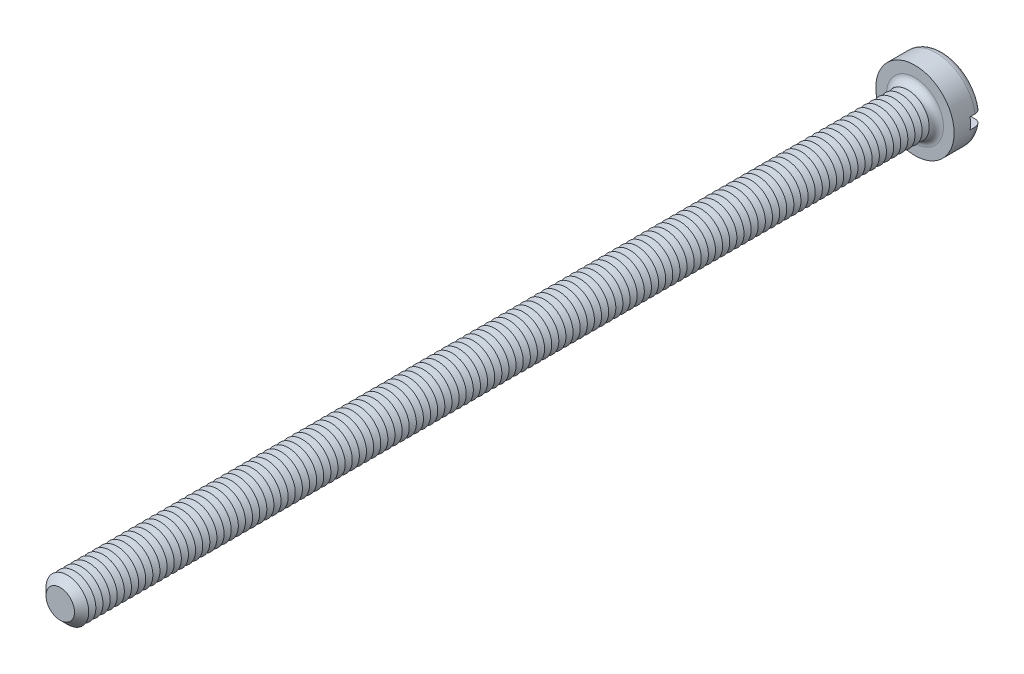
from build123d import *

# Parameters (mm, degrees)
SKETCH3_R           = 2.75
BOSS_EXTRUDE2_DEPTH = 2
SKETCH4_R           = 1.5
BOSS_EXTRUDE3_DEPTH = 60
FILLET1_R           = 0.5
CHAMFER1_SIZE       = 0.5
LPATTERN1_COUNT     = 118
LPATTERN1_PITCH     = 0.5
SKETCH8_W           = 5.5
SKETCH8_H           = 0.8
CUT_EXTRUDE1_DEPTH  = 0.85


with BuildPart() as part:
    # Sketch3 → Boss-Extrude2 (new body)
    with BuildSketch(Plane.XY):
        Circle(SKETCH3_R)
    extrude(amount=-BOSS_EXTRUDE2_DEPTH)

    # Sketch4 → Boss-Extrude3 (add)
    with BuildSketch(Plane.XY):
        Circle(SKETCH4_R)
    extrude(amount=BOSS_EXTRUDE3_DEPTH)

    # Fillet1
    fillet1_edges = [part.edges().sort_by_distance(p)[0] for p in [
        (-2.75, 0, -2),
        (-1.5, 0, 0),
    ]]
    fillet(fillet1_edges, radius=FILLET1_R)

    # Chamfer1
    chamfer1_edges = [part.edges().sort_by_distance(p)[0] for p in [
        (-1.5, 0, 60),
    ]]
    chamfer(chamfer1_edges, length=CHAMFER1_SIZE)

    # Sketch6 → Cut-Revolve1 (revolve, cut)
    with BuildSketch(Plane(origin=(0, 0, 0), x_dir=(0, 0, -1), z_dir=(1, 0, 0)), mode=Mode.PRIVATE) as cut_revolve1_sk:
        Polygon((-0.5, 1.5), (-0.75, 1.066987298), (-1, 1.5), align=None)
    cut_revolve1 = revolve(cut_revolve1_sk.sketch.rotate(Axis((0, 0, -1.694361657), (0, 0, 1)), 90), axis=Axis((0, 0, -1.694361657), (0, 0, 1)), mode=Mode.SUBTRACT)

    # LPattern1: Cut-Revolve1 ×118
    with Locations(*[(0, 0, i * LPATTERN1_PITCH) for i in range(1, LPATTERN1_COUNT)]):
        add(cut_revolve1, mode=Mode.SUBTRACT)

    # Sketch8 → Cut-Extrude1 (cut)
    with BuildSketch(Plane(origin=(0, 0, -2), x_dir=(-1, 0, 0), z_dir=(0, 0, -1))):
        Rectangle(SKETCH8_W, SKETCH8_H)
    extrude(amount=-CUT_EXTRUDE1_DEPTH, mode=Mode.SUBTRACT)


solid = part.part
